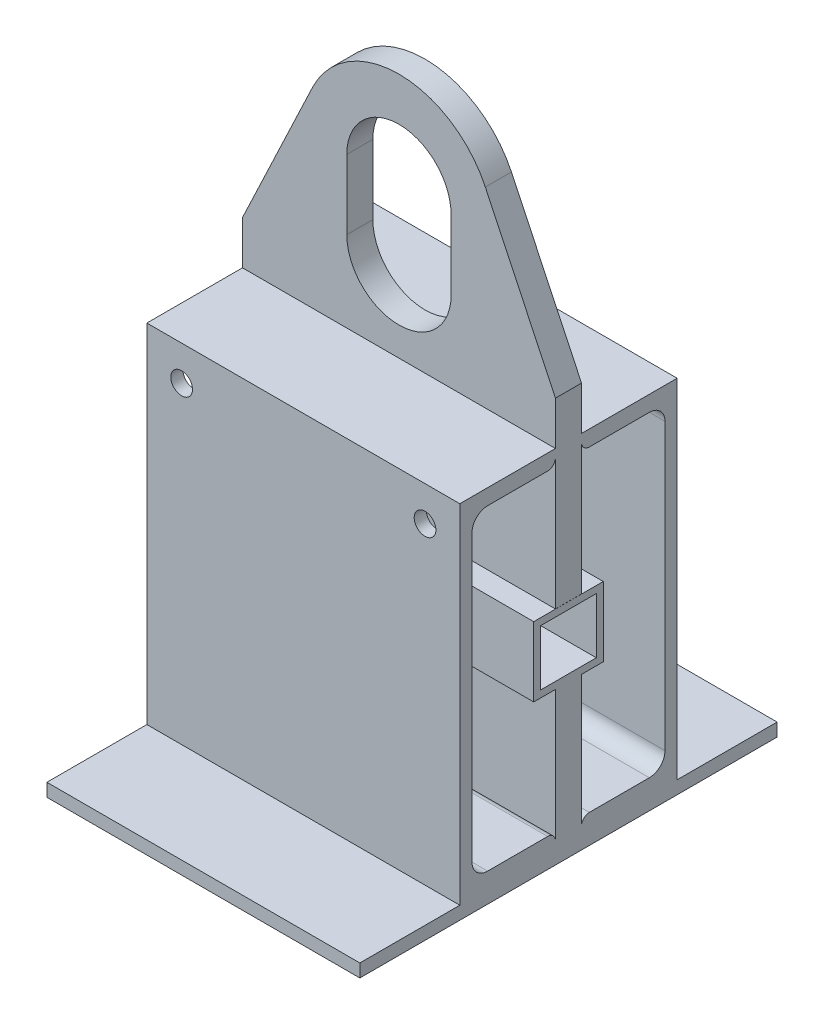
from build123d import *

# Parameters (mm, degrees)
BOSS_EXTRU_1_DEPTH      = 30
ESQUISSE3_W             = 80
ESQUISSE3_H             = 80
ESQUISSE3_W_2           = 64
ESQUISSE3_H_2           = 64
BOSS_EXTRU_2_DEPTH      = 360
ESQUISSE4_W             = 360
ESQUISSE4_H             = 30
BOSS_EXTRU_3_DEPTH      = 160
ESQUISSE5_W             = 360
ESQUISSE5_H             = 480
BOSS_EXTRU_4_DEPTH      = 15
BOSS_EXTRU_5_START      = -107.543186
BOSS_EXTRU_5_DEPTH      = 360
ESQUISSE9_R             = 12.5
ENL_V_MAT_EXTRU_1_DEPTH = 20


with BuildPart() as part:
    # Esquisse2 → Boss.-Extru.1 (new body)
    with BuildSketch(Plane.XY):
        with BuildLine():
            Line((252.456814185, 368.77256622), (171.847570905, 538.757286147))
            ThreePointArc((171.847570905, 538.757286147), (72.456814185, 601.624733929), (-26.933942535, 538.757286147))
            Line((-26.933942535, 538.757286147), (-107.543185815, 368.77256622))
            Line((-107.543185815, 368.77256622), (-107.543185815, 158.77256622))
            Line((-107.543185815, 158.77256622), (252.456814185, 158.77256622))
            Line((252.456814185, 158.77256622), (252.456814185, 368.77256622))
        make_face()
        with BuildLine():
            ThreePointArc((12.456814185, 411.624733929), (72.456814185, 351.624733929), (132.456814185, 411.624733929))
            Line((132.456814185, 411.624733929), (132.456814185, 491.624733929))
            ThreePointArc((132.456814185, 491.624733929), (72.456814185, 551.624733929), (12.456814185, 491.624733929))
            Line((12.456814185, 491.624733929), (12.456814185, 411.624733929))
        make_face(mode=Mode.SUBTRACT)
    extrude(amount=BOSS_EXTRU_1_DEPTH)



with BuildPart() as body_2:
    # Esquisse3 → Boss.-Extru.2 (new body)
    with BuildSketch(Plane.ZY.offset(107.543185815)):
        with Locations((15, 118.629316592)):
            Rectangle(ESQUISSE3_W, ESQUISSE3_H)
        with Locations((15, 118.629316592)):
            Rectangle(ESQUISSE3_W_2, ESQUISSE3_H_2, mode=Mode.SUBTRACT)
    extrude(amount=-BOSS_EXTRU_2_DEPTH)

    # Esquisse4 → Boss.-Extru.3 (add)
    with BuildSketch(Plane(origin=(0, 78.629316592, 0), x_dir=(-1, 0, 0), z_dir=(0, -1, 0))):
        with Locations((-72.456814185, -15)):
            Rectangle(ESQUISSE4_W, ESQUISSE4_H)
    extrude(amount=BOSS_EXTRU_3_DEPTH)

    # Esquisse5 → Boss.-Extru.4 (add)
    with BuildSketch(Plane(origin=(0, -81.370683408, 0), x_dir=(-1, 0, 0), z_dir=(0, -1, 0))):
        with Locations((-72.456814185, -15)):
            Rectangle(ESQUISSE5_W, ESQUISSE5_H)
    extrude(amount=BOSS_EXTRU_4_DEPTH)


with BuildPart() as part_1:
    add(part.part)

    add(body_2.part)  # Boss.-Extru.5 merges body 2
    # Esquisse7 → Boss.-Extru.5 (add)
    with BuildSketch(Plane(origin=(0, 0, 0), x_dir=(0, 0, -1), z_dir=(1, 0, 0)).offset(BOSS_EXTRU_5_START)):
        with BuildLine():
            Line((0, 318.629316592), (110, 318.629316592))
            Line((110, 318.629316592), (110, -81.370683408))
            Line((110, -81.370683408), (0, -81.370683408))
            Line((0, -81.370683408), (0, -72.370683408))
            ThreePointArc((0, -72.370683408), (2.636038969, -66.006722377), (9, -63.370683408))
            Line((9, -63.370683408), (78, -63.370683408))
            ThreePointArc((78, -63.370683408), (90.727922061, -58.098605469), (96, -45.370683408))
            Line((96, -45.370683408), (96, 282.629316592))
            ThreePointArc((96, 282.629316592), (90.727922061, 295.357238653), (78, 300.629316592))
            Line((78, 300.629316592), (9, 300.629316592))
            ThreePointArc((9, 300.629316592), (2.636038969, 303.265355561), (0, 309.629316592))
            Line((0, 309.629316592), (0, 318.629316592))
        make_face()
    boss_extru_5 = extrude(amount=BOSS_EXTRU_5_DEPTH)

    # Sym_trie2: Boss.-Extru.5 across plane
    add(boss_extru_5.mirror(Plane.XY.offset(15)))

    # Esquisse9 → Enl_v. mat.-Extru.1 (cut)
    with BuildSketch(Plane.XY.offset(140)):
        with Locations((212.456814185, 278.629316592)):
            Circle(ESQUISSE9_R)
        with Locations((-67.543185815, 278.629316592)):
            Circle(ESQUISSE9_R)
    enl_v_mat_extru_1 = extrude(amount=-ENL_V_MAT_EXTRU_1_DEPTH, mode=Mode.SUBTRACT)

    # Sym_trie3: Enl_v. mat.-Extru.1 across plane
    add(enl_v_mat_extru_1.mirror(Plane.XY.offset(15)), mode=Mode.SUBTRACT)


solid = part_1.part
